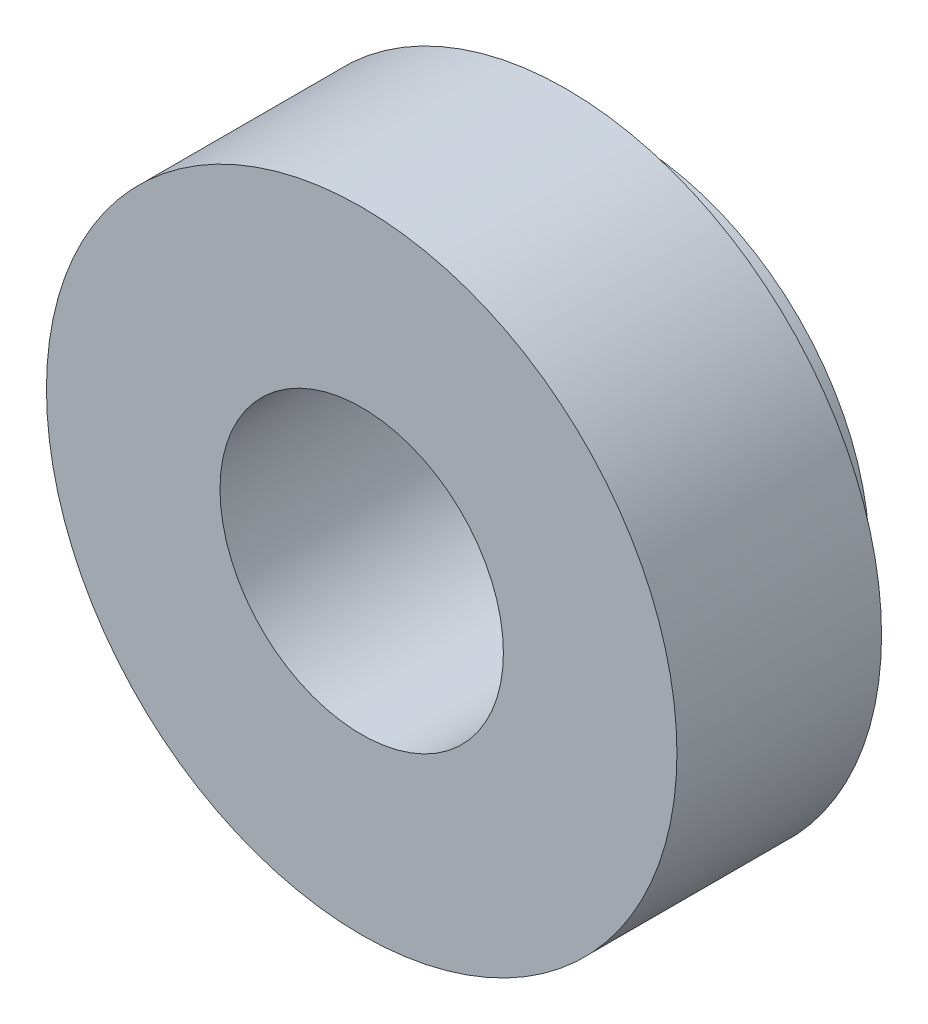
from build123d import *

# Parameters (mm, degrees)
SKETCH1_R          = 15.8496
EXTRUDE1_DEPTH     = 13.462
SKETCH2_OUTSIDE_W  = 43.062
SKETCH2_OUTSIDE_H  = 43.062
SKETCH2_OUTSIDE_R  = 12.065
CUT_EXTRUDE1_DEPTH = 3.175
SKETCH3_R          = 7.1247
CUT_EXTRUDE2_DEPTH = 27.146607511


with BuildPart() as part:
    # Sketch1 → Extrude1 (new body)
    with BuildSketch(Plane.XY):
        Circle(SKETCH1_R)
    extrude(amount=EXTRUDE1_DEPTH)

    # Sketch2 outside → Cut-Extrude1 (cut)
    with BuildSketch(Plane.XY):
        Rectangle(SKETCH2_OUTSIDE_W, SKETCH2_OUTSIDE_H)
        Circle(SKETCH2_OUTSIDE_R, mode=Mode.SUBTRACT)
    extrude(amount=CUT_EXTRUDE1_DEPTH, mode=Mode.SUBTRACT)

    # Sketch3 → Cut-Extrude2 (cut, through all)
    with BuildSketch(Plane(origin=(0, 0, 0), x_dir=(-1, 0, 0), z_dir=(0, 0, -1))):
        Circle(SKETCH3_R)
    extrude(amount=-CUT_EXTRUDE2_DEPTH, mode=Mode.SUBTRACT)


solid = part.part
